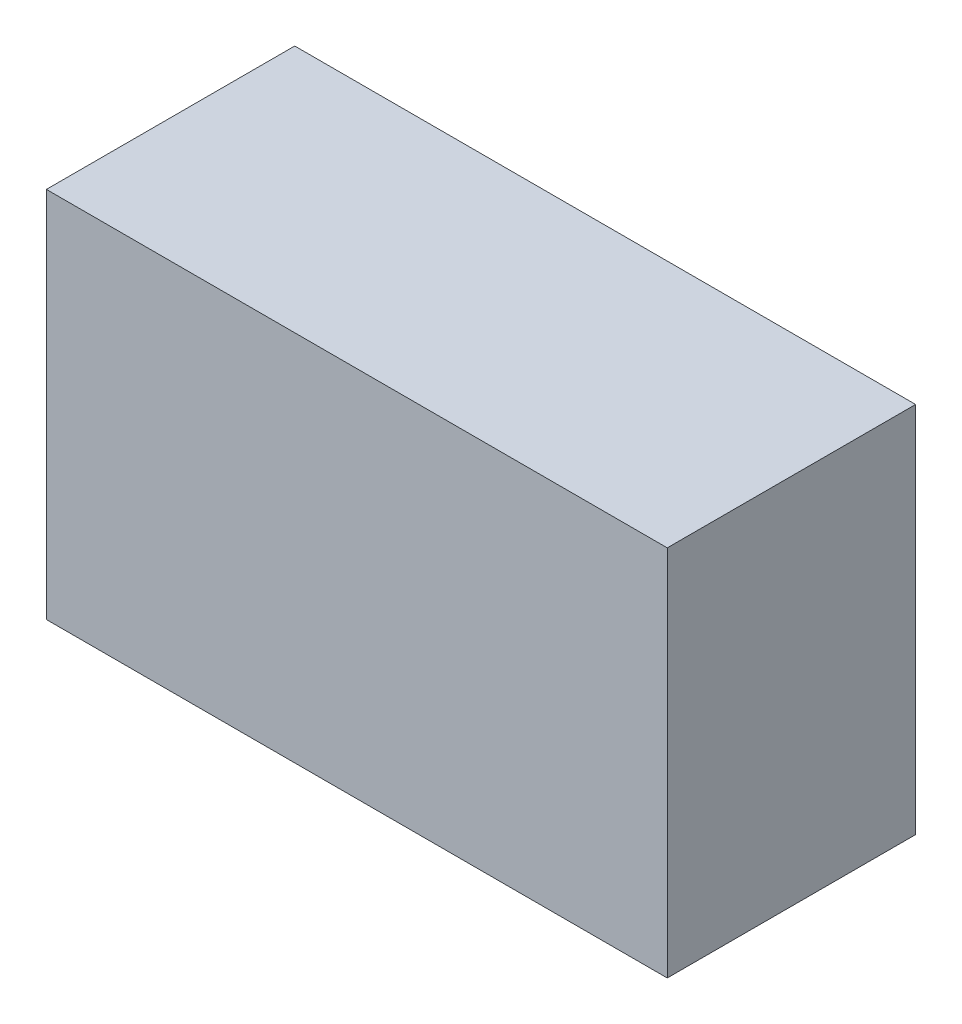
from build123d import *

# Parameters (mm, degrees)
SKETCH1_W            = 38.1
SKETCH1_H            = 25.4
PANEL_OR_BLOCK_DEPTH = 63.5


with BuildPart() as part:
    # Sketch1 → Panel_or_block (new body)
    with BuildSketch(Plane.YZ):
        with Locations((0, 12.7)):
            Rectangle(SKETCH1_W, SKETCH1_H)
    extrude(amount=PANEL_OR_BLOCK_DEPTH)


solid = part.part
